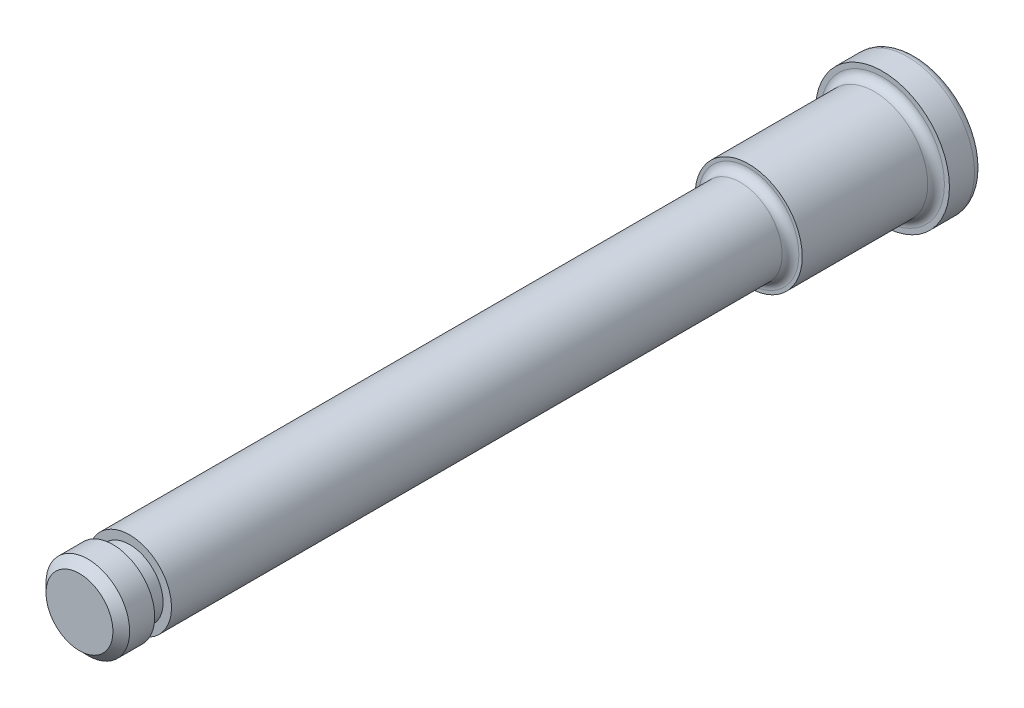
from build123d import *

# Parameters (mm, degrees)
ESQUISSE1_R          = 4
BASE_EXTRUSION_DEPTH = 2
ESQUISSE2_R          = 3.2
BOSS_EXTRU_1_DEPTH   = 8
ESQUISSE3_R          = 2.5
BOSS_EXTRU_2_DEPTH   = 40
CONG_1_R             = 0.5
CHANFREIN1_SIZE      = 0.5
ESQUISSE4_W          = 1
ESQUISSE4_H          = 0.5


with BuildPart() as part:
    # Esquisse1 → Base-Extrusion (new body)
    with BuildSketch(Plane.XY):
        Circle(ESQUISSE1_R)
    extrude(amount=BASE_EXTRUSION_DEPTH)

    # Esquisse2 → Boss.-Extru.1 (add)
    with BuildSketch(Plane.XY.offset(2)):
        Circle(ESQUISSE2_R)
    extrude(amount=BOSS_EXTRU_1_DEPTH)

    # Esquisse3 → Boss.-Extru.2 (add)
    with BuildSketch(Plane.XY.offset(10)):
        with Locations(Location((0, 0, 0), (0, 0, 180))):
            Circle(ESQUISSE3_R)
    extrude(amount=BOSS_EXTRU_2_DEPTH)

    # Cong_1
    cong_1_edges = [part.edges().sort_by_distance(p)[0] for p in [
        (-4, 0, 0),
        (-3.2, 0, 2),
        (2.5, 0, 10),
    ]]
    fillet(cong_1_edges, radius=CONG_1_R)

    # Chanfrein1
    chanfrein1_edges = [part.edges().sort_by_distance(p)[0] for p in [
        (2.5, 0, 50),
    ]]
    chamfer(chanfrein1_edges, length=CHANFREIN1_SIZE)

    # Esquisse4 → Enl_vement de mati_re-R_volution1 (revolve, cut)
    with BuildSketch(Plane(origin=(0, 0, 0), x_dir=(0, 0, -1), z_dir=(1, 0, 0)), mode=Mode.PRIVATE) as enl_vement_de_mati_re_r_volution1_sk:
        with Locations((-47.5, 2.25)):
            Rectangle(ESQUISSE4_W, ESQUISSE4_H)
    revolve(enl_vement_de_mati_re_r_volution1_sk.sketch.rotate(Axis((0, 0, 0), (0, 0, 1)), 90), axis=Axis((0, 0, 0), (0, 0, 1)), mode=Mode.SUBTRACT)


solid = part.part
